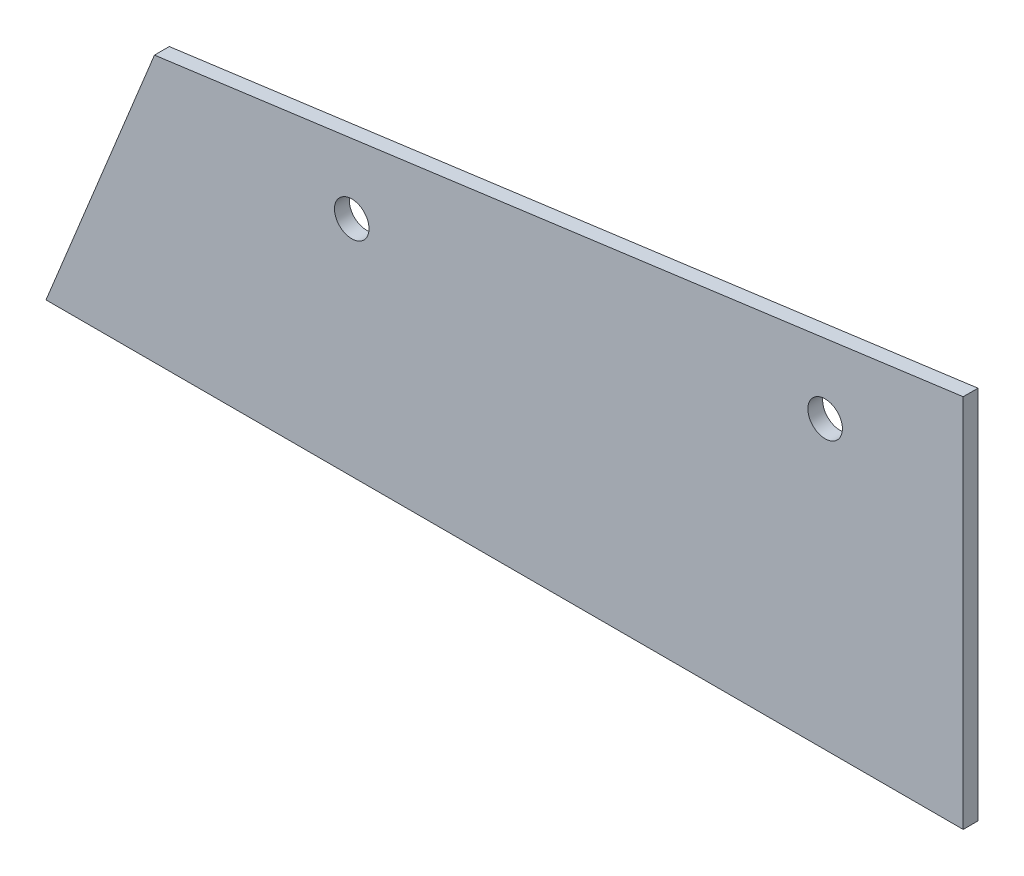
ISO-10303-21;
HEADER;
FILE_DESCRIPTION(('STEP AP214'),'2;1');
FILE_NAME('part.step','',(''),(''),'','','');
FILE_SCHEMA(('AUTOMOTIVE_DESIGN { 1 0 10303 214 1 1 1 1 }'));
ENDSEC;
DATA;
#1=APPLICATION_CONTEXT('core data for automotive mechanical design processes');
#2=APPLICATION_PROTOCOL_DEFINITION('international standard','automotive_design',2000,#1);
#3=PRODUCT_CONTEXT('',#1,'mechanical');
#4=PRODUCT('Part','Part','',(#3));
#5=PRODUCT_RELATED_PRODUCT_CATEGORY('part','',(#4));
#6=PRODUCT_DEFINITION_FORMATION('','',#4);
#7=PRODUCT_DEFINITION_CONTEXT('part definition',#1,'design');
#8=PRODUCT_DEFINITION('design','',#6,#7);
#9=PRODUCT_DEFINITION_SHAPE('','',#8);
#10=(LENGTH_UNIT() NAMED_UNIT(*) SI_UNIT(.MILLI.,.METRE.));
#11=(NAMED_UNIT(*) PLANE_ANGLE_UNIT() SI_UNIT($,.RADIAN.));
#12=(NAMED_UNIT(*) SI_UNIT($,.STERADIAN.) SOLID_ANGLE_UNIT());
#13=UNCERTAINTY_MEASURE_WITH_UNIT(LENGTH_MEASURE(1.E-05),#10,'distance_accuracy_value','');
#14=(GEOMETRIC_REPRESENTATION_CONTEXT(3) GLOBAL_UNCERTAINTY_ASSIGNED_CONTEXT((#13)) GLOBAL_UNIT_ASSIGNED_CONTEXT((#10,
#11,#12)) REPRESENTATION_CONTEXT('',''));
#15=CARTESIAN_POINT('',(0.,0.,0.));
#16=DIRECTION('',(0.,0.,1.));
#17=DIRECTION('',(1.,0.,0.));
#18=AXIS2_PLACEMENT_3D('',#15,#16,#17);
#19=CARTESIAN_POINT('',(0.,0.,1.5));
#20=DIRECTION('',(0.,0.,1.));
#21=DIRECTION('',(1.,0.,0.));
#22=AXIS2_PLACEMENT_3D('',#19,#20,#21);
#23=PLANE('',#22);
#24=CARTESIAN_POINT('',(79.,29.0592487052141,1.5));
#25=DIRECTION('',(0.,0.,1.));
#26=DIRECTION('',(1.,0.,0.));
#27=AXIS2_PLACEMENT_3D('',#24,#25,#26);
#28=CIRCLE('',#27,1.75);
#29=CARTESIAN_POINT('',(80.75,29.0592487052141,1.5));
#30=VERTEX_POINT('',#29);
#31=EDGE_CURVE('E97',#30,#30,#28,.T.);
#32=ORIENTED_EDGE('',*,*,#31,.F.);
#33=EDGE_LOOP('',(#32));
#34=FACE_BOUND('',#33,.T.);
#35=DIRECTION('',(-0.377296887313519,-0.926092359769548,0.));
#36=VECTOR('',#35,1.);
#37=CARTESIAN_POINT('',(11.,27.,1.5));
#38=LINE('',#37,#36);
#39=CARTESIAN_POINT('',(11.,27.,1.5));
#40=VERTEX_POINT('',#39);
#41=CARTESIAN_POINT('',(0.,0.,1.5));
#42=VERTEX_POINT('',#41);
#43=EDGE_CURVE('E82',#40,#42,#38,.T.);
#44=ORIENTED_EDGE('',*,*,#43,.T.);
#45=DIRECTION('',(1.,0.,0.));
#46=VECTOR('',#45,1.);
#47=CARTESIAN_POINT('',(0.,0.,1.5));
#48=LINE('',#47,#46);
#49=CARTESIAN_POINT('',(93.,0.,1.5));
#50=VERTEX_POINT('',#49);
#51=EDGE_CURVE('E77',#42,#50,#48,.T.);
#52=ORIENTED_EDGE('',*,*,#51,.T.);
#53=DIRECTION('',(0.,1.,0.));
#54=VECTOR('',#53,1.);
#55=CARTESIAN_POINT('',(93.,0.,1.5));
#56=LINE('',#55,#54);
#57=CARTESIAN_POINT('',(93.,38.,1.5));
#58=VERTEX_POINT('',#57);
#59=EDGE_CURVE('E80',#50,#58,#56,.T.);
#60=ORIENTED_EDGE('',*,*,#59,.T.);
#61=DIRECTION('',(-0.991122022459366,-0.132955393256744,0.));
#62=VECTOR('',#61,1.);
#63=CARTESIAN_POINT('',(93.,38.,1.5));
#64=LINE('',#63,#62);
#65=EDGE_CURVE('E47',#58,#40,#64,.T.);
#66=ORIENTED_EDGE('',*,*,#65,.T.);
#67=EDGE_LOOP('',(#44,#52,#60,#66));
#68=FACE_BOUND('',#67,.T.);
#69=CARTESIAN_POINT('',(31.,22.6202243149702,1.5));
#70=DIRECTION('',(0.,0.,1.));
#71=DIRECTION('',(1.,0.,0.));
#72=AXIS2_PLACEMENT_3D('',#69,#70,#71);
#73=CIRCLE('',#72,1.75000000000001);
#74=CARTESIAN_POINT('',(32.75,22.6202243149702,1.5));
#75=VERTEX_POINT('',#74);
#76=EDGE_CURVE('E112',#75,#75,#73,.T.);
#77=ORIENTED_EDGE('',*,*,#76,.F.);
#78=EDGE_LOOP('',(#77));
#79=FACE_BOUND('',#78,.T.);
#80=ADVANCED_FACE('F30',(#34,#68,#79),#23,.T.);
#81=CARTESIAN_POINT('',(0.,0.,0.));
#82=DIRECTION('',(0.,0.,1.));
#83=DIRECTION('',(1.,0.,0.));
#84=AXIS2_PLACEMENT_3D('',#81,#82,#83);
#85=PLANE('',#84);
#86=CARTESIAN_POINT('',(79.,29.0592487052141,0.));
#87=DIRECTION('',(0.,0.,1.));
#88=DIRECTION('',(1.,0.,0.));
#89=AXIS2_PLACEMENT_3D('',#86,#87,#88);
#90=CIRCLE('',#89,1.75);
#91=CARTESIAN_POINT('',(80.75,29.0592487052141,0.));
#92=VERTEX_POINT('',#91);
#93=EDGE_CURVE('E109',#92,#92,#90,.T.);
#94=ORIENTED_EDGE('',*,*,#93,.T.);
#95=EDGE_LOOP('',(#94));
#96=FACE_BOUND('',#95,.T.);
#97=DIRECTION('',(-0.377296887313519,-0.926092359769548,0.));
#98=VECTOR('',#97,1.);
#99=CARTESIAN_POINT('',(11.,27.,0.));
#100=LINE('',#99,#98);
#101=CARTESIAN_POINT('',(11.,27.,0.));
#102=VERTEX_POINT('',#101);
#103=CARTESIAN_POINT('',(0.,0.,0.));
#104=VERTEX_POINT('',#103);
#105=EDGE_CURVE('E94',#102,#104,#100,.T.);
#106=ORIENTED_EDGE('',*,*,#105,.F.);
#107=DIRECTION('',(-0.991122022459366,-0.132955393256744,0.));
#108=VECTOR('',#107,1.);
#109=CARTESIAN_POINT('',(93.,38.,0.));
#110=LINE('',#109,#108);
#111=CARTESIAN_POINT('',(93.,38.,0.));
#112=VERTEX_POINT('',#111);
#113=EDGE_CURVE('E70',#112,#102,#110,.T.);
#114=ORIENTED_EDGE('',*,*,#113,.F.);
#115=DIRECTION('',(0.,1.,0.));
#116=VECTOR('',#115,1.);
#117=CARTESIAN_POINT('',(93.,0.,0.));
#118=LINE('',#117,#116);
#119=CARTESIAN_POINT('',(93.,0.,0.));
#120=VERTEX_POINT('',#119);
#121=EDGE_CURVE('E64',#120,#112,#118,.T.);
#122=ORIENTED_EDGE('',*,*,#121,.F.);
#123=DIRECTION('',(1.,0.,0.));
#124=VECTOR('',#123,1.);
#125=CARTESIAN_POINT('',(0.,0.,0.));
#126=LINE('',#125,#124);
#127=EDGE_CURVE('E86',#104,#120,#126,.T.);
#128=ORIENTED_EDGE('',*,*,#127,.F.);
#129=EDGE_LOOP('',(#106,#114,#122,#128));
#130=FACE_BOUND('',#129,.T.);
#131=CARTESIAN_POINT('',(31.,22.6202243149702,0.));
#132=DIRECTION('',(0.,0.,1.));
#133=DIRECTION('',(1.,0.,0.));
#134=AXIS2_PLACEMENT_3D('',#131,#132,#133);
#135=CIRCLE('',#134,1.75000000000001);
#136=CARTESIAN_POINT('',(32.75,22.6202243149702,0.));
#137=VERTEX_POINT('',#136);
#138=EDGE_CURVE('E115',#137,#137,#135,.T.);
#139=ORIENTED_EDGE('',*,*,#138,.T.);
#140=EDGE_LOOP('',(#139));
#141=FACE_BOUND('',#140,.T.);
#142=ADVANCED_FACE('F105',(#96,#130,#141),#85,.F.);
#143=CARTESIAN_POINT('',(11.,27.,1.5));
#144=DIRECTION('',(0.926092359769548,-0.377296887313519,0.));
#145=DIRECTION('',(0.377296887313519,0.926092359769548,0.));
#146=AXIS2_PLACEMENT_3D('',#143,#144,#145);
#147=PLANE('',#146);
#148=ORIENTED_EDGE('',*,*,#105,.T.);
#149=DIRECTION('',(0.,0.,-1.));
#150=VECTOR('',#149,1.);
#151=CARTESIAN_POINT('',(0.,0.,1.5));
#152=LINE('',#151,#150);
#153=EDGE_CURVE('E11',#42,#104,#152,.T.);
#154=ORIENTED_EDGE('',*,*,#153,.F.);
#155=ORIENTED_EDGE('',*,*,#43,.F.);
#156=DIRECTION('',(0.,0.,-1.));
#157=VECTOR('',#156,1.);
#158=CARTESIAN_POINT('',(11.,27.,1.5));
#159=LINE('',#158,#157);
#160=EDGE_CURVE('E90',#40,#102,#159,.T.);
#161=ORIENTED_EDGE('',*,*,#160,.T.);
#162=EDGE_LOOP('',(#148,#154,#155,#161));
#163=FACE_BOUND('',#162,.T.);
#164=ADVANCED_FACE('F32',(#163),#147,.F.);
#165=CARTESIAN_POINT('',(0.,0.,1.5));
#166=DIRECTION('',(0.,1.,0.));
#167=DIRECTION('',(0.,0.,1.));
#168=AXIS2_PLACEMENT_3D('',#165,#166,#167);
#169=PLANE('',#168);
#170=ORIENTED_EDGE('',*,*,#127,.T.);
#171=DIRECTION('',(0.,0.,-1.));
#172=VECTOR('',#171,1.);
#173=CARTESIAN_POINT('',(93.,0.,1.5));
#174=LINE('',#173,#172);
#175=EDGE_CURVE('E39',#50,#120,#174,.T.);
#176=ORIENTED_EDGE('',*,*,#175,.F.);
#177=ORIENTED_EDGE('',*,*,#51,.F.);
#178=ORIENTED_EDGE('',*,*,#153,.T.);
#179=EDGE_LOOP('',(#170,#176,#177,#178));
#180=FACE_BOUND('',#179,.T.);
#181=ADVANCED_FACE('F85',(#180),#169,.F.);
#182=CARTESIAN_POINT('',(93.,0.,1.5));
#183=DIRECTION('',(-1.,0.,0.));
#184=DIRECTION('',(0.,0.,1.));
#185=AXIS2_PLACEMENT_3D('',#182,#183,#184);
#186=PLANE('',#185);
#187=ORIENTED_EDGE('',*,*,#121,.T.);
#188=DIRECTION('',(0.,0.,-1.));
#189=VECTOR('',#188,1.);
#190=CARTESIAN_POINT('',(93.,38.,1.5));
#191=LINE('',#190,#189);
#192=EDGE_CURVE('E87',#58,#112,#191,.T.);
#193=ORIENTED_EDGE('',*,*,#192,.F.);
#194=ORIENTED_EDGE('',*,*,#59,.F.);
#195=ORIENTED_EDGE('',*,*,#175,.T.);
#196=EDGE_LOOP('',(#187,#193,#194,#195));
#197=FACE_BOUND('',#196,.T.);
#198=ADVANCED_FACE('F88',(#197),#186,.F.);
#199=CARTESIAN_POINT('',(93.,38.,1.5));
#200=DIRECTION('',(0.132955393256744,-0.991122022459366,0.));
#201=DIRECTION('',(0.991122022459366,0.132955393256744,0.));
#202=AXIS2_PLACEMENT_3D('',#199,#200,#201);
#203=PLANE('',#202);
#204=ORIENTED_EDGE('',*,*,#113,.T.);
#205=ORIENTED_EDGE('',*,*,#160,.F.);
#206=ORIENTED_EDGE('',*,*,#65,.F.);
#207=ORIENTED_EDGE('',*,*,#192,.T.);
#208=EDGE_LOOP('',(#204,#205,#206,#207));
#209=FACE_BOUND('',#208,.T.);
#210=ADVANCED_FACE('F102',(#209),#203,.F.);
#211=CARTESIAN_POINT('',(79.,29.0592487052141,1.5));
#212=DIRECTION('',(0.,0.,-1.));
#213=DIRECTION('',(-1.,0.,0.));
#214=AXIS2_PLACEMENT_3D('',#211,#212,#213);
#215=CYLINDRICAL_SURFACE('',#214,1.75);
#216=ORIENTED_EDGE('',*,*,#31,.T.);
#217=EDGE_LOOP('',(#216));
#218=FACE_BOUND('',#217,.T.);
#219=ORIENTED_EDGE('',*,*,#93,.F.);
#220=EDGE_LOOP('',(#219));
#221=FACE_BOUND('',#220,.T.);
#222=ADVANCED_FACE('F133',(#218,#221),#215,.F.);
#223=CARTESIAN_POINT('',(31.,22.6202243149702,1.5));
#224=DIRECTION('',(0.,0.,-1.));
#225=DIRECTION('',(-1.,0.,0.));
#226=AXIS2_PLACEMENT_3D('',#223,#224,#225);
#227=CYLINDRICAL_SURFACE('',#226,1.75000000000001);
#228=ORIENTED_EDGE('',*,*,#76,.T.);
#229=EDGE_LOOP('',(#228));
#230=FACE_BOUND('',#229,.T.);
#231=ORIENTED_EDGE('',*,*,#138,.F.);
#232=EDGE_LOOP('',(#231));
#233=FACE_BOUND('',#232,.T.);
#234=ADVANCED_FACE('F121',(#230,#233),#227,.F.);
#235=CLOSED_SHELL('',(#80,#142,#164,#181,#198,#210,#222,#234));
#236=MANIFOLD_SOLID_BREP('B2',#235);
#237=ADVANCED_BREP_SHAPE_REPRESENTATION('',(#18,#236),#14);
#238=SHAPE_DEFINITION_REPRESENTATION(#9,#237);
ENDSEC;
END-ISO-10303-21;
